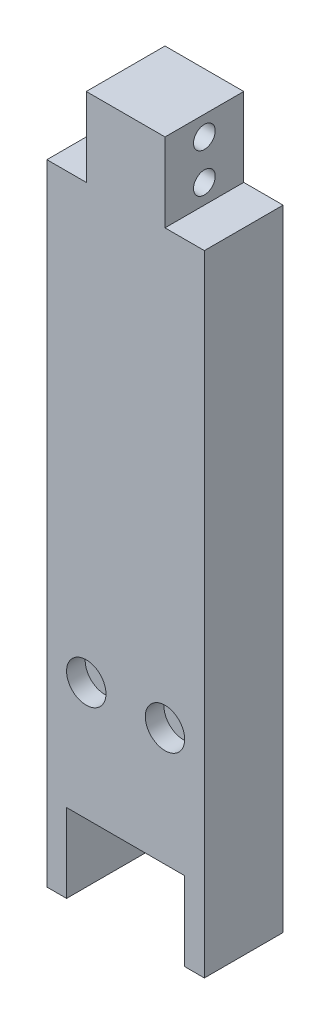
from build123d import *

# Parameters (mm, degrees)
BOSS_EXTRUDE1_DEPTH = 12.7
SKETCH2_R           = 1.7526
CUT_EXTRUDE1_DEPTH  = 12.7
SKETCH3_R           = 3.175
CUT_EXTRUDE2_DEPTH  = 15.700000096
SKETCH5_W           = 19.05
SKETCH5_H           = 12.7
CUT_EXTRUDE3_DEPTH  = 12.7
SKETCH6_R           = 3.175
CUT_EXTRUDE4_DEPTH  = 3


with BuildPart() as part:
    # Sketch1 → Boss-Extrude1 (new body)
    with BuildSketch(Plane.XY):
        Polygon((-6.35, 38.1), (-6.35, 25.4), (-12.7, 25.4), (-12.7, -76.2), (12.7, -76.2), (12.7, 25.4), (6.35, 25.4), (6.35, 38.1), align=None)
    extrude(amount=BOSS_EXTRUDE1_DEPTH)

    # Sketch2 → Cut-Extrude1 (cut)
    with BuildSketch(Plane(origin=(6.35, 0, 0), x_dir=(0, 0, -1), z_dir=(1, 0, 0))):
        with Locations(Location((-6.35, 34.924240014, 0), (0, 0, 90))):
            Circle(SKETCH2_R)
        with Locations(Location((-6.35, 28.575, 0), (0, 0, 90))):
            Circle(SKETCH2_R)
    extrude(amount=-CUT_EXTRUDE1_DEPTH, mode=Mode.SUBTRACT)

    # Sketch3 → Cut-Extrude2 (cut)
    with BuildSketch(Plane(origin=(0, -76.2, 0), x_dir=(-1, 0, 0), z_dir=(0, -1, 0))):
        with Locations(Location((4.7625, -6.35, 0), (0, 0, 90))):
            Circle(SKETCH3_R)
        with Locations(Location((-4.7625, -6.35, 0), (0, 0, 90))):
            Circle(SKETCH3_R)
    extrude(amount=-CUT_EXTRUDE2_DEPTH, mode=Mode.SUBTRACT)

    # Sketch5 → Cut-Extrude3 (cut)
    with BuildSketch(Plane.XZ.offset(76.2)):
        with Locations((0, 6.35)):
            Rectangle(SKETCH5_W, SKETCH5_H)
    extrude(amount=-CUT_EXTRUDE3_DEPTH, mode=Mode.SUBTRACT)

    # Sketch6 → Cut-Extrude4 (cut)
    with BuildSketch(Plane.XY.offset(12.7)):
        with Locations((-6.35, -44.45)):
            Circle(SKETCH6_R)
        with Locations((6.35, -44.45)):
            Circle(SKETCH6_R)
    extrude(amount=-CUT_EXTRUDE4_DEPTH, mode=Mode.SUBTRACT)


solid = part.part
